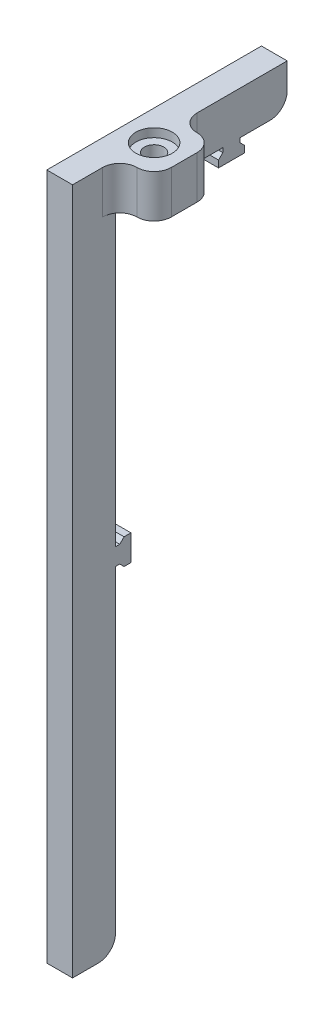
ISO-10303-21;
HEADER;
FILE_DESCRIPTION(('STEP AP214'),'2;1');
FILE_NAME('part.step','',(''),(''),'','','');
FILE_SCHEMA(('AUTOMOTIVE_DESIGN { 1 0 10303 214 1 1 1 1 }'));
ENDSEC;
DATA;
#1=APPLICATION_CONTEXT('core data for automotive mechanical design processes');
#2=APPLICATION_PROTOCOL_DEFINITION('international standard','automotive_design',2000,#1);
#3=PRODUCT_CONTEXT('',#1,'mechanical');
#4=PRODUCT('Part','Part','',(#3));
#5=PRODUCT_RELATED_PRODUCT_CATEGORY('part','',(#4));
#6=PRODUCT_DEFINITION_FORMATION('','',#4);
#7=PRODUCT_DEFINITION_CONTEXT('part definition',#1,'design');
#8=PRODUCT_DEFINITION('design','',#6,#7);
#9=PRODUCT_DEFINITION_SHAPE('','',#8);
#10=(LENGTH_UNIT() NAMED_UNIT(*) SI_UNIT(.MILLI.,.METRE.));
#11=(NAMED_UNIT(*) PLANE_ANGLE_UNIT() SI_UNIT($,.RADIAN.));
#12=(NAMED_UNIT(*) SI_UNIT($,.STERADIAN.) SOLID_ANGLE_UNIT());
#13=UNCERTAINTY_MEASURE_WITH_UNIT(LENGTH_MEASURE(1.E-05),#10,'distance_accuracy_value','');
#14=(GEOMETRIC_REPRESENTATION_CONTEXT(3) GLOBAL_UNCERTAINTY_ASSIGNED_CONTEXT((#13)) GLOBAL_UNIT_ASSIGNED_CONTEXT((#10,
#11,#12)) REPRESENTATION_CONTEXT('',''));
#15=CARTESIAN_POINT('',(0.,0.,0.));
#16=DIRECTION('',(0.,0.,1.));
#17=DIRECTION('',(1.,0.,0.));
#18=AXIS2_PLACEMENT_3D('',#15,#16,#17);
#19=CARTESIAN_POINT('',(6.,-160.,-10.));
#20=DIRECTION('',(0.,0.,1.));
#21=DIRECTION('',(1.,0.,0.));
#22=AXIS2_PLACEMENT_3D('',#19,#20,#21);
#23=PLANE('',#22);
#24=DIRECTION('',(0.,1.,0.));
#25=VECTOR('',#24,1.);
#26=CARTESIAN_POINT('',(6.,-160.,-10.));
#27=LINE('',#26,#25);
#28=CARTESIAN_POINT('',(6.,-78.,-10.));
#29=VERTEX_POINT('',#28);
#30=CARTESIAN_POINT('',(6.,-9.99999999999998,-10.));
#31=VERTEX_POINT('',#30);
#32=EDGE_CURVE('E297',#29,#31,#27,.T.);
#33=ORIENTED_EDGE('',*,*,#32,.F.);
#34=DIRECTION('',(-1.,0.,0.));
#35=VECTOR('',#34,1.);
#36=CARTESIAN_POINT('',(6.,-78.,-10.));
#37=LINE('',#36,#35);
#38=CARTESIAN_POINT('',(0.,-78.,-10.));
#39=VERTEX_POINT('',#38);
#40=EDGE_CURVE('E316',#29,#39,#37,.T.);
#41=ORIENTED_EDGE('',*,*,#40,.T.);
#42=DIRECTION('',(0.,1.,0.));
#43=VECTOR('',#42,1.);
#44=CARTESIAN_POINT('',(0.,-160.,-10.));
#45=LINE('',#44,#43);
#46=CARTESIAN_POINT('',(0.,-9.99999999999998,-10.));
#47=VERTEX_POINT('',#46);
#48=EDGE_CURVE('E414',#39,#47,#45,.T.);
#49=ORIENTED_EDGE('',*,*,#48,.T.);
#50=DIRECTION('',(-1.,0.,0.));
#51=VECTOR('',#50,1.);
#52=CARTESIAN_POINT('',(6.,-9.99999999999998,-10.));
#53=LINE('',#52,#51);
#54=EDGE_CURVE('E428',#31,#47,#53,.T.);
#55=ORIENTED_EDGE('',*,*,#54,.F.);
#56=EDGE_LOOP('',(#33,#41,#49,#55));
#57=FACE_BOUND('',#56,.T.);
#58=ADVANCED_FACE('F41',(#57),#23,.F.);
#59=CARTESIAN_POINT('',(6.,-9.99999999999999,-50.));
#60=DIRECTION('',(0.,1.,0.));
#61=DIRECTION('',(0.,0.,1.));
#62=AXIS2_PLACEMENT_3D('',#59,#60,#61);
#63=PLANE('',#62);
#64=CARTESIAN_POINT('',(7.,-9.99999999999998,-18.));
#65=DIRECTION('',(0.,1.,0.));
#66=DIRECTION('',(0.,0.,1.));
#67=AXIS2_PLACEMENT_3D('',#64,#65,#66);
#68=CIRCLE('',#67,5.25);
#69=CARTESIAN_POINT('',(7.,-9.99999999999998,-12.75));
#70=VERTEX_POINT('',#69);
#71=EDGE_CURVE('E437',#70,#70,#68,.T.);
#72=ORIENTED_EDGE('',*,*,#71,.T.);
#73=EDGE_LOOP('',(#72));
#74=FACE_BOUND('',#73,.T.);
#75=DIRECTION('',(0.,0.,-1.));
#76=VECTOR('',#75,1.);
#77=CARTESIAN_POINT('',(0.,-9.99999999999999,-50.));
#78=LINE('',#77,#76);
#79=CARTESIAN_POINT('',(0.,-9.99999999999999,-35.));
#80=VERTEX_POINT('',#79);
#81=EDGE_CURVE('E418',#47,#80,#78,.T.);
#82=ORIENTED_EDGE('',*,*,#81,.T.);
#83=DIRECTION('',(-1.,0.,0.));
#84=VECTOR('',#83,1.);
#85=CARTESIAN_POINT('',(6.,-9.99999999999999,-35.));
#86=LINE('',#85,#84);
#87=CARTESIAN_POINT('',(6.,-9.99999999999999,-35.));
#88=VERTEX_POINT('',#87);
#89=EDGE_CURVE('E64',#88,#80,#86,.T.);
#90=ORIENTED_EDGE('',*,*,#89,.F.);
#91=DIRECTION('',(0.,0.,-1.));
#92=VECTOR('',#91,1.);
#93=CARTESIAN_POINT('',(6.,-9.99999999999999,-50.));
#94=LINE('',#93,#92);
#95=CARTESIAN_POINT('',(6.,-9.99999999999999,-29.));
#96=VERTEX_POINT('',#95);
#97=EDGE_CURVE('E400',#96,#88,#94,.T.);
#98=ORIENTED_EDGE('',*,*,#97,.F.);
#99=CARTESIAN_POINT('',(10.,-9.99999999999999,-29.));
#100=DIRECTION('',(0.,1.,0.));
#101=DIRECTION('',(0.,0.,1.));
#102=AXIS2_PLACEMENT_3D('',#99,#100,#101);
#103=CIRCLE('',#102,4.);
#104=CARTESIAN_POINT('',(10.,-9.99999999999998,-25.));
#105=VERTEX_POINT('',#104);
#106=EDGE_CURVE('E466',#96,#105,#103,.T.);
#107=ORIENTED_EDGE('',*,*,#106,.T.);
#108=CARTESIAN_POINT('',(10.,-9.99999999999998,-21.));
#109=DIRECTION('',(0.,1.,0.));
#110=DIRECTION('',(0.,0.,1.));
#111=AXIS2_PLACEMENT_3D('',#108,#109,#110);
#112=CIRCLE('',#111,4.);
#113=CARTESIAN_POINT('',(14.,-9.99999999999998,-21.));
#114=VERTEX_POINT('',#113);
#115=EDGE_CURVE('E454',#105,#114,#112,.F.);
#116=ORIENTED_EDGE('',*,*,#115,.T.);
#117=DIRECTION('',(0.,0.,-1.));
#118=VECTOR('',#117,1.);
#119=CARTESIAN_POINT('',(14.,-9.99999999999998,-25.));
#120=LINE('',#119,#118);
#121=CARTESIAN_POINT('',(14.,-9.99999999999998,-15.));
#122=VERTEX_POINT('',#121);
#123=EDGE_CURVE('E385',#122,#114,#120,.T.);
#124=ORIENTED_EDGE('',*,*,#123,.F.);
#125=CARTESIAN_POINT('',(10.,-9.99999999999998,-15.));
#126=DIRECTION('',(0.,1.,0.));
#127=DIRECTION('',(0.,0.,1.));
#128=AXIS2_PLACEMENT_3D('',#125,#126,#127);
#129=CIRCLE('',#128,4.);
#130=CARTESIAN_POINT('',(10.,-9.99999999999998,-11.));
#131=VERTEX_POINT('',#130);
#132=EDGE_CURVE('E456',#122,#131,#129,.F.);
#133=ORIENTED_EDGE('',*,*,#132,.T.);
#134=CARTESIAN_POINT('',(10.,-9.99999999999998,-7.));
#135=DIRECTION('',(0.,1.,0.));
#136=DIRECTION('',(0.,0.,1.));
#137=AXIS2_PLACEMENT_3D('',#134,#135,#136);
#138=CIRCLE('',#137,4.);
#139=CARTESIAN_POINT('',(6.,-9.99999999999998,-7.));
#140=VERTEX_POINT('',#139);
#141=EDGE_CURVE('E460',#131,#140,#138,.T.);
#142=ORIENTED_EDGE('',*,*,#141,.T.);
#143=DIRECTION('',(0.,0.,-1.));
#144=VECTOR('',#143,1.);
#145=CARTESIAN_POINT('',(6.,-9.99999999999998,0.));
#146=LINE('',#145,#144);
#147=EDGE_CURVE('E370',#140,#31,#146,.T.);
#148=ORIENTED_EDGE('',*,*,#147,.T.);
#149=ORIENTED_EDGE('',*,*,#54,.T.);
#150=EDGE_LOOP('',(#82,#90,#98,#107,#116,#124,#133,#142,#148,#149));
#151=FACE_BOUND('',#150,.T.);
#152=ADVANCED_FACE('F537',(#74,#151),#63,.F.);
#153=CARTESIAN_POINT('',(7.,-16.,-18.));
#154=DIRECTION('',(0.,1.,0.));
#155=DIRECTION('',(0.,0.,1.));
#156=AXIS2_PLACEMENT_3D('',#153,#154,#155);
#157=CYLINDRICAL_SURFACE('',#156,4.25);
#158=CARTESIAN_POINT('',(7.,-8.99999999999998,-18.));
#159=DIRECTION('',(0.,1.,0.));
#160=DIRECTION('',(0.,0.,1.));
#161=AXIS2_PLACEMENT_3D('',#158,#159,#160);
#162=CIRCLE('',#161,4.25);
#163=CARTESIAN_POINT('',(7.,-8.99999999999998,-13.75));
#164=VERTEX_POINT('',#163);
#165=EDGE_CURVE('E440',#164,#164,#162,.F.);
#166=ORIENTED_EDGE('',*,*,#165,.T.);
#167=EDGE_LOOP('',(#166));
#168=FACE_BOUND('',#167,.T.);
#169=CARTESIAN_POINT('',(7.,-7.99999999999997,-18.));
#170=DIRECTION('',(0.,1.,0.));
#171=DIRECTION('',(0.,0.,1.));
#172=AXIS2_PLACEMENT_3D('',#169,#170,#171);
#173=CIRCLE('',#172,4.25);
#174=CARTESIAN_POINT('',(7.,-7.99999999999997,-13.75));
#175=VERTEX_POINT('',#174);
#176=EDGE_CURVE('E434',#175,#175,#173,.T.);
#177=ORIENTED_EDGE('',*,*,#176,.T.);
#178=EDGE_LOOP('',(#177));
#179=FACE_BOUND('',#178,.T.);
#180=ADVANCED_FACE('F614',(#168,#179),#157,.F.);
#181=CARTESIAN_POINT('',(6.,0.,0.));
#182=DIRECTION('',(1.,0.,0.));
#183=DIRECTION('',(0.,0.,-1.));
#184=AXIS2_PLACEMENT_3D('',#181,#182,#183);
#185=PLANE('',#184);
#186=ORIENTED_EDGE('',*,*,#97,.T.);
#187=DIRECTION('',(0.,1.,0.));
#188=VECTOR('',#187,1.);
#189=CARTESIAN_POINT('',(6.,-11.,-35.));
#190=LINE('',#189,#188);
#191=CARTESIAN_POINT('',(6.,-11.,-35.));
#192=VERTEX_POINT('',#191);
#193=EDGE_CURVE('E278',#192,#88,#190,.T.);
#194=ORIENTED_EDGE('',*,*,#193,.F.);
#195=DIRECTION('',(0.,0.707106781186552,-0.707106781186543));
#196=VECTOR('',#195,1.);
#197=CARTESIAN_POINT('',(6.,-12.,-34.));
#198=LINE('',#197,#196);
#199=CARTESIAN_POINT('',(6.,-12.,-34.));
#200=VERTEX_POINT('',#199);
#201=EDGE_CURVE('E275',#200,#192,#198,.T.);
#202=ORIENTED_EDGE('',*,*,#201,.F.);
#203=DIRECTION('',(0.,1.,0.));
#204=VECTOR('',#203,1.);
#205=CARTESIAN_POINT('',(6.,-13.6,-34.));
#206=LINE('',#205,#204);
#207=CARTESIAN_POINT('',(6.,-13.6,-34.));
#208=VERTEX_POINT('',#207);
#209=EDGE_CURVE('E272',#208,#200,#206,.T.);
#210=ORIENTED_EDGE('',*,*,#209,.F.);
#211=DIRECTION('',(0.,0.,1.));
#212=VECTOR('',#211,1.);
#213=CARTESIAN_POINT('',(6.,-13.6,-40.));
#214=LINE('',#213,#212);
#215=CARTESIAN_POINT('',(6.,-13.6,-40.));
#216=VERTEX_POINT('',#215);
#217=EDGE_CURVE('E269',#216,#208,#214,.T.);
#218=ORIENTED_EDGE('',*,*,#217,.F.);
#219=DIRECTION('',(0.,-1.,0.));
#220=VECTOR('',#219,1.);
#221=CARTESIAN_POINT('',(6.,-12.,-40.));
#222=LINE('',#221,#220);
#223=CARTESIAN_POINT('',(6.,-12.,-40.));
#224=VERTEX_POINT('',#223);
#225=EDGE_CURVE('E259',#224,#216,#222,.T.);
#226=ORIENTED_EDGE('',*,*,#225,.F.);
#227=DIRECTION('',(0.,-0.707106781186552,-0.707106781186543));
#228=VECTOR('',#227,1.);
#229=CARTESIAN_POINT('',(6.,-11.,-39.));
#230=LINE('',#229,#228);
#231=CARTESIAN_POINT('',(6.,-11.,-39.));
#232=VERTEX_POINT('',#231);
#233=EDGE_CURVE('E242',#232,#224,#230,.T.);
#234=ORIENTED_EDGE('',*,*,#233,.F.);
#235=DIRECTION('',(0.,-1.,0.));
#236=VECTOR('',#235,1.);
#237=CARTESIAN_POINT('',(6.,-9.99999999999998,-39.));
#238=LINE('',#237,#236);
#239=CARTESIAN_POINT('',(6.,-9.99999999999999,-39.));
#240=VERTEX_POINT('',#239);
#241=EDGE_CURVE('E256',#240,#232,#238,.T.);
#242=ORIENTED_EDGE('',*,*,#241,.F.);
#243=CARTESIAN_POINT('',(6.,-9.99999999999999,-46.));
#244=VERTEX_POINT('',#243);
#245=EDGE_CURVE('E56',#240,#244,#94,.T.);
#246=ORIENTED_EDGE('',*,*,#245,.T.);
#247=CARTESIAN_POINT('',(6.,-5.99999999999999,-46.));
#248=DIRECTION('',(1.,0.,0.));
#249=DIRECTION('',(0.,0.,-1.));
#250=AXIS2_PLACEMENT_3D('',#247,#248,#249);
#251=CIRCLE('',#250,4.);
#252=CARTESIAN_POINT('',(6.,-5.99999999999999,-50.));
#253=VERTEX_POINT('',#252);
#254=EDGE_CURVE('E482',#244,#253,#251,.T.);
#255=ORIENTED_EDGE('',*,*,#254,.T.);
#256=DIRECTION('',(0.,1.,0.));
#257=VECTOR('',#256,1.);
#258=CARTESIAN_POINT('',(6.,-9.99999999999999,-50.));
#259=LINE('',#258,#257);
#260=CARTESIAN_POINT('',(6.,0.,-50.));
#261=VERTEX_POINT('',#260);
#262=EDGE_CURVE('E402',#253,#261,#259,.T.);
#263=ORIENTED_EDGE('',*,*,#262,.T.);
#264=DIRECTION('',(0.,0.,1.));
#265=VECTOR('',#264,1.);
#266=CARTESIAN_POINT('',(6.,0.,0.));
#267=LINE('',#266,#265);
#268=CARTESIAN_POINT('',(6.,0.,-29.));
#269=VERTEX_POINT('',#268);
#270=EDGE_CURVE('E405',#261,#269,#267,.T.);
#271=ORIENTED_EDGE('',*,*,#270,.T.);
#272=DIRECTION('',(0.,1.,0.));
#273=VECTOR('',#272,1.);
#274=CARTESIAN_POINT('',(6.,-9.99999999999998,-29.));
#275=LINE('',#274,#273);
#276=EDGE_CURVE('E458',#269,#96,#275,.F.);
#277=ORIENTED_EDGE('',*,*,#276,.T.);
#278=EDGE_LOOP('',(#186,#194,#202,#210,#218,#226,#234,#242,#246,#255,#263,#271,#277));
#279=FACE_BOUND('',#278,.T.);
#280=ADVANCED_FACE('F255',(#279),#185,.T.);
#281=CARTESIAN_POINT('',(6.,0.,0.));
#282=DIRECTION('',(0.,0.,-1.));
#283=DIRECTION('',(-1.,0.,0.));
#284=AXIS2_PLACEMENT_3D('',#281,#282,#283);
#285=PLANE('',#284);
#286=DIRECTION('',(0.,-1.,0.));
#287=VECTOR('',#286,1.);
#288=CARTESIAN_POINT('',(0.,0.,0.));
#289=LINE('',#288,#287);
#290=CARTESIAN_POINT('',(0.,0.,0.));
#291=VERTEX_POINT('',#290);
#292=CARTESIAN_POINT('',(0.,-160.,0.));
#293=VERTEX_POINT('',#292);
#294=EDGE_CURVE('E393',#291,#293,#289,.T.);
#295=ORIENTED_EDGE('',*,*,#294,.T.);
#296=DIRECTION('',(-1.,0.,0.));
#297=VECTOR('',#296,1.);
#298=CARTESIAN_POINT('',(6.,-160.,0.));
#299=LINE('',#298,#297);
#300=CARTESIAN_POINT('',(6.,-160.,0.));
#301=VERTEX_POINT('',#300);
#302=EDGE_CURVE('E431',#301,#293,#299,.T.);
#303=ORIENTED_EDGE('',*,*,#302,.F.);
#304=DIRECTION('',(0.,-1.,0.));
#305=VECTOR('',#304,1.);
#306=CARTESIAN_POINT('',(6.,0.,0.));
#307=LINE('',#306,#305);
#308=CARTESIAN_POINT('',(6.,0.,0.));
#309=VERTEX_POINT('',#308);
#310=EDGE_CURVE('E394',#309,#301,#307,.T.);
#311=ORIENTED_EDGE('',*,*,#310,.F.);
#312=DIRECTION('',(-1.,0.,0.));
#313=VECTOR('',#312,1.);
#314=CARTESIAN_POINT('',(6.,0.,0.));
#315=LINE('',#314,#313);
#316=EDGE_CURVE('E408',#309,#291,#315,.T.);
#317=ORIENTED_EDGE('',*,*,#316,.T.);
#318=EDGE_LOOP('',(#295,#303,#311,#317));
#319=FACE_BOUND('',#318,.T.);
#320=ADVANCED_FACE('F576',(#319),#285,.F.);
#321=CARTESIAN_POINT('',(6.,-160.,0.));
#322=DIRECTION('',(0.,1.,0.));
#323=DIRECTION('',(0.,0.,1.));
#324=AXIS2_PLACEMENT_3D('',#321,#322,#323);
#325=PLANE('',#324);
#326=DIRECTION('',(0.,0.,-1.));
#327=VECTOR('',#326,1.);
#328=CARTESIAN_POINT('',(0.,-160.,0.));
#329=LINE('',#328,#327);
#330=CARTESIAN_POINT('',(0.,-160.,-6.00000000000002));
#331=VERTEX_POINT('',#330);
#332=EDGE_CURVE('E411',#293,#331,#329,.T.);
#333=ORIENTED_EDGE('',*,*,#332,.T.);
#334=DIRECTION('',(-1.,0.,0.));
#335=VECTOR('',#334,1.);
#336=CARTESIAN_POINT('',(6.,-160.,-6.00000000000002));
#337=LINE('',#336,#335);
#338=CARTESIAN_POINT('',(6.,-160.,-6.00000000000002));
#339=VERTEX_POINT('',#338);
#340=EDGE_CURVE('E49',#331,#339,#337,.F.);
#341=ORIENTED_EDGE('',*,*,#340,.T.);
#342=DIRECTION('',(0.,0.,-1.));
#343=VECTOR('',#342,1.);
#344=CARTESIAN_POINT('',(6.,-160.,0.));
#345=LINE('',#344,#343);
#346=EDGE_CURVE('E396',#301,#339,#345,.T.);
#347=ORIENTED_EDGE('',*,*,#346,.F.);
#348=ORIENTED_EDGE('',*,*,#302,.T.);
#349=EDGE_LOOP('',(#333,#341,#347,#348));
#350=FACE_BOUND('',#349,.T.);
#351=ADVANCED_FACE('F489',(#350),#325,.F.);
#352=CARTESIAN_POINT('',(0.,-156.,-10.));
#353=VERTEX_POINT('',#352);
#354=CARTESIAN_POINT('',(0.,-82.,-10.));
#355=VERTEX_POINT('',#354);
#356=EDGE_CURVE('E415',#353,#355,#45,.T.);
#357=ORIENTED_EDGE('',*,*,#356,.T.);
#358=DIRECTION('',(-1.,0.,0.));
#359=VECTOR('',#358,1.);
#360=CARTESIAN_POINT('',(6.,-82.,-10.));
#361=LINE('',#360,#359);
#362=CARTESIAN_POINT('',(6.,-82.,-10.));
#363=VERTEX_POINT('',#362);
#364=EDGE_CURVE('E313',#363,#355,#361,.T.);
#365=ORIENTED_EDGE('',*,*,#364,.F.);
#366=CARTESIAN_POINT('',(6.,-156.,-10.));
#367=VERTEX_POINT('',#366);
#368=EDGE_CURVE('E367',#367,#363,#27,.T.);
#369=ORIENTED_EDGE('',*,*,#368,.F.);
#370=DIRECTION('',(-1.,0.,0.));
#371=VECTOR('',#370,1.);
#372=CARTESIAN_POINT('',(6.,-156.,-10.));
#373=LINE('',#372,#371);
#374=EDGE_CURVE('E484',#367,#353,#373,.T.);
#375=ORIENTED_EDGE('',*,*,#374,.T.);
#376=EDGE_LOOP('',(#357,#365,#369,#375));
#377=FACE_BOUND('',#376,.T.);
#378=ADVANCED_FACE('F500',(#377),#23,.F.);
#379=ORIENTED_EDGE('',*,*,#245,.F.);
#380=DIRECTION('',(-1.,0.,0.));
#381=VECTOR('',#380,1.);
#382=CARTESIAN_POINT('',(6.,-9.99999999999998,-39.));
#383=LINE('',#382,#381);
#384=CARTESIAN_POINT('',(0.,-9.99999999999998,-39.));
#385=VERTEX_POINT('',#384);
#386=EDGE_CURVE('E250',#240,#385,#383,.T.);
#387=ORIENTED_EDGE('',*,*,#386,.T.);
#388=CARTESIAN_POINT('',(0.,-9.99999999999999,-46.));
#389=VERTEX_POINT('',#388);
#390=EDGE_CURVE('E417',#385,#389,#78,.T.);
#391=ORIENTED_EDGE('',*,*,#390,.T.);
#392=DIRECTION('',(-1.,0.,0.));
#393=VECTOR('',#392,1.);
#394=CARTESIAN_POINT('',(6.,-9.99999999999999,-46.));
#395=LINE('',#394,#393);
#396=EDGE_CURVE('E480',#389,#244,#395,.F.);
#397=ORIENTED_EDGE('',*,*,#396,.T.);
#398=EDGE_LOOP('',(#379,#387,#391,#397));
#399=FACE_BOUND('',#398,.T.);
#400=ADVANCED_FACE('F587',(#399),#63,.F.);
#401=CARTESIAN_POINT('',(6.,-9.99999999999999,-50.));
#402=DIRECTION('',(0.,0.,1.));
#403=DIRECTION('',(1.,0.,0.));
#404=AXIS2_PLACEMENT_3D('',#401,#402,#403);
#405=PLANE('',#404);
#406=ORIENTED_EDGE('',*,*,#262,.F.);
#407=DIRECTION('',(-1.,0.,0.));
#408=VECTOR('',#407,1.);
#409=CARTESIAN_POINT('',(6.,-5.99999999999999,-50.));
#410=LINE('',#409,#408);
#411=CARTESIAN_POINT('',(0.,-5.99999999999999,-50.));
#412=VERTEX_POINT('',#411);
#413=EDGE_CURVE('E468',#253,#412,#410,.T.);
#414=ORIENTED_EDGE('',*,*,#413,.T.);
#415=DIRECTION('',(0.,1.,0.));
#416=VECTOR('',#415,1.);
#417=CARTESIAN_POINT('',(0.,-9.99999999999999,-50.));
#418=LINE('',#417,#416);
#419=CARTESIAN_POINT('',(0.,0.,-50.));
#420=VERTEX_POINT('',#419);
#421=EDGE_CURVE('E420',#412,#420,#418,.T.);
#422=ORIENTED_EDGE('',*,*,#421,.T.);
#423=DIRECTION('',(-1.,0.,0.));
#424=VECTOR('',#423,1.);
#425=CARTESIAN_POINT('',(6.,0.,-50.));
#426=LINE('',#425,#424);
#427=EDGE_CURVE('E425',#261,#420,#426,.T.);
#428=ORIENTED_EDGE('',*,*,#427,.F.);
#429=EDGE_LOOP('',(#406,#414,#422,#428));
#430=FACE_BOUND('',#429,.T.);
#431=ADVANCED_FACE('F581',(#430),#405,.F.);
#432=CARTESIAN_POINT('',(6.,0.,0.));
#433=DIRECTION('',(0.,-1.,0.));
#434=DIRECTION('',(0.,0.,-1.));
#435=AXIS2_PLACEMENT_3D('',#432,#433,#434);
#436=PLANE('',#435);
#437=CARTESIAN_POINT('',(7.,0.,-18.));
#438=DIRECTION('',(0.,1.,0.));
#439=DIRECTION('',(0.,0.,1.));
#440=AXIS2_PLACEMENT_3D('',#437,#438,#439);
#441=CIRCLE('',#440,4.25);
#442=CARTESIAN_POINT('',(7.,0.,-13.75));
#443=VERTEX_POINT('',#442);
#444=EDGE_CURVE('E388',#443,#443,#441,.T.);
#445=ORIENTED_EDGE('',*,*,#444,.F.);
#446=EDGE_LOOP('',(#445));
#447=FACE_BOUND('',#446,.T.);
#448=CARTESIAN_POINT('',(6.,0.,-7.));
#449=VERTEX_POINT('',#448);
#450=EDGE_CURVE('E404',#449,#309,#267,.T.);
#451=ORIENTED_EDGE('',*,*,#450,.F.);
#452=CARTESIAN_POINT('',(10.,0.,-7.));
#453=DIRECTION('',(0.,-1.,0.));
#454=DIRECTION('',(0.,0.,-1.));
#455=AXIS2_PLACEMENT_3D('',#452,#453,#454);
#456=CIRCLE('',#455,4.);
#457=CARTESIAN_POINT('',(10.,0.,-11.));
#458=VERTEX_POINT('',#457);
#459=EDGE_CURVE('E462',#449,#458,#456,.T.);
#460=ORIENTED_EDGE('',*,*,#459,.T.);
#461=CARTESIAN_POINT('',(10.,0.,-15.));
#462=DIRECTION('',(0.,-1.,0.));
#463=DIRECTION('',(0.,0.,-1.));
#464=AXIS2_PLACEMENT_3D('',#461,#462,#463);
#465=CIRCLE('',#464,4.);
#466=CARTESIAN_POINT('',(14.,0.,-15.));
#467=VERTEX_POINT('',#466);
#468=EDGE_CURVE('E447',#458,#467,#465,.F.);
#469=ORIENTED_EDGE('',*,*,#468,.T.);
#470=DIRECTION('',(0.,0.,-1.));
#471=VECTOR('',#470,1.);
#472=CARTESIAN_POINT('',(14.,0.,-25.));
#473=LINE('',#472,#471);
#474=CARTESIAN_POINT('',(14.,0.,-21.));
#475=VERTEX_POINT('',#474);
#476=EDGE_CURVE('E384',#467,#475,#473,.T.);
#477=ORIENTED_EDGE('',*,*,#476,.T.);
#478=CARTESIAN_POINT('',(10.,0.,-21.));
#479=DIRECTION('',(0.,-1.,0.));
#480=DIRECTION('',(0.,0.,-1.));
#481=AXIS2_PLACEMENT_3D('',#478,#479,#480);
#482=CIRCLE('',#481,4.);
#483=CARTESIAN_POINT('',(10.,0.,-25.));
#484=VERTEX_POINT('',#483);
#485=EDGE_CURVE('E445',#475,#484,#482,.F.);
#486=ORIENTED_EDGE('',*,*,#485,.T.);
#487=CARTESIAN_POINT('',(10.,0.,-29.));
#488=DIRECTION('',(0.,-1.,0.));
#489=DIRECTION('',(0.,0.,-1.));
#490=AXIS2_PLACEMENT_3D('',#487,#488,#489);
#491=CIRCLE('',#490,4.);
#492=EDGE_CURVE('E464',#484,#269,#491,.T.);
#493=ORIENTED_EDGE('',*,*,#492,.T.);
#494=ORIENTED_EDGE('',*,*,#270,.F.);
#495=ORIENTED_EDGE('',*,*,#427,.T.);
#496=DIRECTION('',(0.,0.,1.));
#497=VECTOR('',#496,1.);
#498=CARTESIAN_POINT('',(0.,0.,0.));
#499=LINE('',#498,#497);
#500=EDGE_CURVE('E397',#420,#291,#499,.T.);
#501=ORIENTED_EDGE('',*,*,#500,.T.);
#502=ORIENTED_EDGE('',*,*,#316,.F.);
#503=EDGE_LOOP('',(#451,#460,#469,#477,#486,#493,#494,#495,#501,#502));
#504=FACE_BOUND('',#503,.T.);
#505=ADVANCED_FACE('F572',(#447,#504),#436,.F.);
#506=ORIENTED_EDGE('',*,*,#346,.T.);
#507=CARTESIAN_POINT('',(6.,-156.,-6.00000000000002));
#508=DIRECTION('',(1.,0.,0.));
#509=DIRECTION('',(0.,0.,-1.));
#510=AXIS2_PLACEMENT_3D('',#507,#508,#509);
#511=CIRCLE('',#510,4.);
#512=EDGE_CURVE('E11',#339,#367,#511,.T.);
#513=ORIENTED_EDGE('',*,*,#512,.T.);
#514=ORIENTED_EDGE('',*,*,#368,.T.);
#515=DIRECTION('',(0.,0.,1.));
#516=VECTOR('',#515,1.);
#517=CARTESIAN_POINT('',(6.,-82.,-10.));
#518=LINE('',#517,#516);
#519=CARTESIAN_POINT('',(6.,-82.,-11.));
#520=VERTEX_POINT('',#519);
#521=EDGE_CURVE('E359',#520,#363,#518,.T.);
#522=ORIENTED_EDGE('',*,*,#521,.F.);
#523=DIRECTION('',(0.,0.707106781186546,0.707106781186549));
#524=VECTOR('',#523,1.);
#525=CARTESIAN_POINT('',(6.,-82.,-11.));
#526=LINE('',#525,#524);
#527=CARTESIAN_POINT('',(6.,-83.,-12.));
#528=VERTEX_POINT('',#527);
#529=EDGE_CURVE('E362',#528,#520,#526,.T.);
#530=ORIENTED_EDGE('',*,*,#529,.F.);
#531=DIRECTION('',(0.,0.,1.));
#532=VECTOR('',#531,1.);
#533=CARTESIAN_POINT('',(6.,-83.,-12.));
#534=LINE('',#533,#532);
#535=CARTESIAN_POINT('',(6.,-83.,-13.6));
#536=VERTEX_POINT('',#535);
#537=EDGE_CURVE('E331',#536,#528,#534,.T.);
#538=ORIENTED_EDGE('',*,*,#537,.F.);
#539=DIRECTION('',(0.,-1.,0.));
#540=VECTOR('',#539,1.);
#541=CARTESIAN_POINT('',(6.,-83.,-13.6));
#542=LINE('',#541,#540);
#543=CARTESIAN_POINT('',(6.,-77.,-13.6));
#544=VERTEX_POINT('',#543);
#545=EDGE_CURVE('E310',#544,#536,#542,.T.);
#546=ORIENTED_EDGE('',*,*,#545,.F.);
#547=DIRECTION('',(0.,0.,-1.));
#548=VECTOR('',#547,1.);
#549=CARTESIAN_POINT('',(6.,-77.,-13.6));
#550=LINE('',#549,#548);
#551=CARTESIAN_POINT('',(6.,-77.,-12.));
#552=VERTEX_POINT('',#551);
#553=EDGE_CURVE('E350',#552,#544,#550,.T.);
#554=ORIENTED_EDGE('',*,*,#553,.F.);
#555=DIRECTION('',(0.,0.707106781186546,-0.707106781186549));
#556=VECTOR('',#555,1.);
#557=CARTESIAN_POINT('',(6.,-77.,-12.));
#558=LINE('',#557,#556);
#559=CARTESIAN_POINT('',(6.,-78.,-11.));
#560=VERTEX_POINT('',#559);
#561=EDGE_CURVE('E353',#560,#552,#558,.T.);
#562=ORIENTED_EDGE('',*,*,#561,.F.);
#563=DIRECTION('',(0.,0.,-1.));
#564=VECTOR('',#563,1.);
#565=CARTESIAN_POINT('',(6.,-78.,-11.));
#566=LINE('',#565,#564);
#567=EDGE_CURVE('E356',#29,#560,#566,.T.);
#568=ORIENTED_EDGE('',*,*,#567,.F.);
#569=ORIENTED_EDGE('',*,*,#32,.T.);
#570=ORIENTED_EDGE('',*,*,#147,.F.);
#571=DIRECTION('',(0.,-1.,0.));
#572=VECTOR('',#571,1.);
#573=CARTESIAN_POINT('',(6.,0.,-7.));
#574=LINE('',#573,#572);
#575=EDGE_CURVE('E443',#140,#449,#574,.F.);
#576=ORIENTED_EDGE('',*,*,#575,.T.);
#577=ORIENTED_EDGE('',*,*,#450,.T.);
#578=ORIENTED_EDGE('',*,*,#310,.T.);
#579=EDGE_LOOP('',(#506,#513,#514,#522,#530,#538,#546,#554,#562,#568,#569,#570,#576,#577,#578));
#580=FACE_BOUND('',#579,.T.);
#581=ADVANCED_FACE('F494',(#580),#185,.T.);
#582=CARTESIAN_POINT('',(0.,0.,0.));
#583=DIRECTION('',(1.,0.,0.));
#584=DIRECTION('',(0.,0.,-1.));
#585=AXIS2_PLACEMENT_3D('',#582,#583,#584);
#586=PLANE('',#585);
#587=ORIENTED_EDGE('',*,*,#421,.F.);
#588=CARTESIAN_POINT('',(0.,-5.99999999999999,-46.));
#589=DIRECTION('',(1.,0.,0.));
#590=DIRECTION('',(0.,0.,-1.));
#591=AXIS2_PLACEMENT_3D('',#588,#589,#590);
#592=CIRCLE('',#591,4.);
#593=EDGE_CURVE('E477',#412,#389,#592,.F.);
#594=ORIENTED_EDGE('',*,*,#593,.T.);
#595=ORIENTED_EDGE('',*,*,#390,.F.);
#596=DIRECTION('',(0.,-1.,0.));
#597=VECTOR('',#596,1.);
#598=CARTESIAN_POINT('',(0.,-9.99999999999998,-39.));
#599=LINE('',#598,#597);
#600=CARTESIAN_POINT('',(0.,-11.,-39.));
#601=VERTEX_POINT('',#600);
#602=EDGE_CURVE('E281',#385,#601,#599,.T.);
#603=ORIENTED_EDGE('',*,*,#602,.T.);
#604=DIRECTION('',(0.,-0.707106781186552,-0.707106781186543));
#605=VECTOR('',#604,1.);
#606=CARTESIAN_POINT('',(0.,-11.,-39.));
#607=LINE('',#606,#605);
#608=CARTESIAN_POINT('',(0.,-12.,-40.));
#609=VERTEX_POINT('',#608);
#610=EDGE_CURVE('E244',#601,#609,#607,.T.);
#611=ORIENTED_EDGE('',*,*,#610,.T.);
#612=DIRECTION('',(0.,-1.,0.));
#613=VECTOR('',#612,1.);
#614=CARTESIAN_POINT('',(0.,-12.,-40.));
#615=LINE('',#614,#613);
#616=CARTESIAN_POINT('',(0.,-13.6,-40.));
#617=VERTEX_POINT('',#616);
#618=EDGE_CURVE('E285',#609,#617,#615,.T.);
#619=ORIENTED_EDGE('',*,*,#618,.T.);
#620=DIRECTION('',(0.,0.,1.));
#621=VECTOR('',#620,1.);
#622=CARTESIAN_POINT('',(0.,-13.6,-40.));
#623=LINE('',#622,#621);
#624=CARTESIAN_POINT('',(0.,-13.6,-34.));
#625=VERTEX_POINT('',#624);
#626=EDGE_CURVE('E288',#617,#625,#623,.T.);
#627=ORIENTED_EDGE('',*,*,#626,.T.);
#628=DIRECTION('',(0.,1.,0.));
#629=VECTOR('',#628,1.);
#630=CARTESIAN_POINT('',(0.,-13.6,-34.));
#631=LINE('',#630,#629);
#632=CARTESIAN_POINT('',(0.,-12.,-34.));
#633=VERTEX_POINT('',#632);
#634=EDGE_CURVE('E291',#625,#633,#631,.T.);
#635=ORIENTED_EDGE('',*,*,#634,.T.);
#636=DIRECTION('',(0.,0.707106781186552,-0.707106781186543));
#637=VECTOR('',#636,1.);
#638=CARTESIAN_POINT('',(0.,-12.,-34.));
#639=LINE('',#638,#637);
#640=CARTESIAN_POINT('',(0.,-11.,-35.));
#641=VERTEX_POINT('',#640);
#642=EDGE_CURVE('E265',#633,#641,#639,.T.);
#643=ORIENTED_EDGE('',*,*,#642,.T.);
#644=DIRECTION('',(0.,1.,0.));
#645=VECTOR('',#644,1.);
#646=CARTESIAN_POINT('',(0.,-11.,-35.));
#647=LINE('',#646,#645);
#648=EDGE_CURVE('E262',#641,#80,#647,.T.);
#649=ORIENTED_EDGE('',*,*,#648,.T.);
#650=ORIENTED_EDGE('',*,*,#81,.F.);
#651=ORIENTED_EDGE('',*,*,#48,.F.);
#652=DIRECTION('',(0.,0.,-1.));
#653=VECTOR('',#652,1.);
#654=CARTESIAN_POINT('',(0.,-78.,-11.));
#655=LINE('',#654,#653);
#656=CARTESIAN_POINT('',(0.,-78.,-11.));
#657=VERTEX_POINT('',#656);
#658=EDGE_CURVE('E337',#39,#657,#655,.T.);
#659=ORIENTED_EDGE('',*,*,#658,.T.);
#660=DIRECTION('',(0.,0.707106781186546,-0.707106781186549));
#661=VECTOR('',#660,1.);
#662=CARTESIAN_POINT('',(0.,-77.,-12.));
#663=LINE('',#662,#661);
#664=CARTESIAN_POINT('',(0.,-77.,-12.));
#665=VERTEX_POINT('',#664);
#666=EDGE_CURVE('E334',#657,#665,#663,.T.);
#667=ORIENTED_EDGE('',*,*,#666,.T.);
#668=DIRECTION('',(0.,0.,-1.));
#669=VECTOR('',#668,1.);
#670=CARTESIAN_POINT('',(0.,-77.,-13.6));
#671=LINE('',#670,#669);
#672=CARTESIAN_POINT('',(0.,-77.,-13.6));
#673=VERTEX_POINT('',#672);
#674=EDGE_CURVE('E330',#665,#673,#671,.T.);
#675=ORIENTED_EDGE('',*,*,#674,.T.);
#676=DIRECTION('',(0.,-1.,0.));
#677=VECTOR('',#676,1.);
#678=CARTESIAN_POINT('',(0.,-83.,-13.6));
#679=LINE('',#678,#677);
#680=CARTESIAN_POINT('',(0.,-83.,-13.6));
#681=VERTEX_POINT('',#680);
#682=EDGE_CURVE('E327',#673,#681,#679,.T.);
#683=ORIENTED_EDGE('',*,*,#682,.T.);
#684=DIRECTION('',(0.,0.,1.));
#685=VECTOR('',#684,1.);
#686=CARTESIAN_POINT('',(0.,-83.,-12.));
#687=LINE('',#686,#685);
#688=CARTESIAN_POINT('',(0.,-83.,-12.));
#689=VERTEX_POINT('',#688);
#690=EDGE_CURVE('E283',#681,#689,#687,.T.);
#691=ORIENTED_EDGE('',*,*,#690,.T.);
#692=DIRECTION('',(0.,0.707106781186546,0.707106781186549));
#693=VECTOR('',#692,1.);
#694=CARTESIAN_POINT('',(0.,-82.,-11.));
#695=LINE('',#694,#693);
#696=CARTESIAN_POINT('',(0.,-82.,-11.));
#697=VERTEX_POINT('',#696);
#698=EDGE_CURVE('E343',#689,#697,#695,.T.);
#699=ORIENTED_EDGE('',*,*,#698,.T.);
#700=DIRECTION('',(0.,0.,1.));
#701=VECTOR('',#700,1.);
#702=CARTESIAN_POINT('',(0.,-82.,-10.));
#703=LINE('',#702,#701);
#704=EDGE_CURVE('E340',#697,#355,#703,.T.);
#705=ORIENTED_EDGE('',*,*,#704,.T.);
#706=ORIENTED_EDGE('',*,*,#356,.F.);
#707=CARTESIAN_POINT('',(0.,-156.,-6.00000000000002));
#708=DIRECTION('',(1.,0.,0.));
#709=DIRECTION('',(0.,0.,-1.));
#710=AXIS2_PLACEMENT_3D('',#707,#708,#709);
#711=CIRCLE('',#710,4.);
#712=EDGE_CURVE('E475',#353,#331,#711,.F.);
#713=ORIENTED_EDGE('',*,*,#712,.T.);
#714=ORIENTED_EDGE('',*,*,#332,.F.);
#715=ORIENTED_EDGE('',*,*,#294,.F.);
#716=ORIENTED_EDGE('',*,*,#500,.F.);
#717=EDGE_LOOP('',(#587,#594,#595,#603,#611,#619,#627,#635,#643,#649,#650,#651,#659,#667,#675,
#683,#691,#699,#705,#706,#713,#714,#715,#716));
#718=FACE_BOUND('',#717,.T.);
#719=ADVANCED_FACE('F503',(#718),#586,.F.);
#720=CARTESIAN_POINT('',(7.,-2.,-18.));
#721=DIRECTION('',(0.,1.,0.));
#722=DIRECTION('',(0.,0.,1.));
#723=AXIS2_PLACEMENT_3D('',#720,#721,#722);
#724=CIRCLE('',#723,4.25);
#725=CARTESIAN_POINT('',(7.,-2.,-13.75));
#726=VERTEX_POINT('',#725);
#727=EDGE_CURVE('E377',#726,#726,#724,.T.);
#728=ORIENTED_EDGE('',*,*,#727,.F.);
#729=EDGE_LOOP('',(#728));
#730=FACE_BOUND('',#729,.T.);
#731=ORIENTED_EDGE('',*,*,#444,.T.);
#732=EDGE_LOOP('',(#731));
#733=FACE_BOUND('',#732,.T.);
#734=ADVANCED_FACE('F683',(#730,#733),#157,.F.);
#735=CARTESIAN_POINT('',(14.,-9.99999999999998,-25.));
#736=DIRECTION('',(1.,0.,0.));
#737=DIRECTION('',(0.,0.,-1.));
#738=AXIS2_PLACEMENT_3D('',#735,#736,#737);
#739=PLANE('',#738);
#740=ORIENTED_EDGE('',*,*,#476,.F.);
#741=DIRECTION('',(0.,1.,0.));
#742=VECTOR('',#741,1.);
#743=CARTESIAN_POINT('',(14.,-9.99999999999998,-15.));
#744=LINE('',#743,#742);
#745=EDGE_CURVE('E452',#467,#122,#744,.F.);
#746=ORIENTED_EDGE('',*,*,#745,.T.);
#747=ORIENTED_EDGE('',*,*,#123,.T.);
#748=DIRECTION('',(0.,1.,0.));
#749=VECTOR('',#748,1.);
#750=CARTESIAN_POINT('',(14.,-9.99999999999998,-21.));
#751=LINE('',#750,#749);
#752=EDGE_CURVE('E449',#114,#475,#751,.T.);
#753=ORIENTED_EDGE('',*,*,#752,.T.);
#754=EDGE_LOOP('',(#740,#746,#747,#753));
#755=FACE_BOUND('',#754,.T.);
#756=ADVANCED_FACE('F560',(#755),#739,.T.);
#757=CARTESIAN_POINT('',(7.,-2.,-18.));
#758=DIRECTION('',(0.,1.,0.));
#759=DIRECTION('',(0.,0.,1.));
#760=AXIS2_PLACEMENT_3D('',#757,#758,#759);
#761=PLANE('',#760);
#762=CARTESIAN_POINT('',(7.,-2.,-18.));
#763=DIRECTION('',(0.,1.,0.));
#764=DIRECTION('',(0.,0.,1.));
#765=AXIS2_PLACEMENT_3D('',#762,#763,#764);
#766=CIRCLE('',#765,2.25);
#767=CARTESIAN_POINT('',(7.,-2.,-15.75));
#768=VERTEX_POINT('',#767);
#769=EDGE_CURVE('E378',#768,#768,#766,.T.);
#770=ORIENTED_EDGE('',*,*,#769,.F.);
#771=EDGE_LOOP('',(#770));
#772=FACE_BOUND('',#771,.T.);
#773=ORIENTED_EDGE('',*,*,#727,.T.);
#774=EDGE_LOOP('',(#773));
#775=FACE_BOUND('',#774,.T.);
#776=ADVANCED_FACE('F676',(#772,#775),#761,.T.);
#777=CARTESIAN_POINT('',(7.,-6.,-18.));
#778=DIRECTION('',(0.,1.,0.));
#779=DIRECTION('',(0.,0.,1.));
#780=AXIS2_PLACEMENT_3D('',#777,#778,#779);
#781=CYLINDRICAL_SURFACE('',#780,2.25);
#782=CARTESIAN_POINT('',(7.,-6.,-18.));
#783=DIRECTION('',(0.,1.,0.));
#784=DIRECTION('',(0.,0.,1.));
#785=AXIS2_PLACEMENT_3D('',#782,#783,#784);
#786=CIRCLE('',#785,2.25);
#787=CARTESIAN_POINT('',(7.,-6.,-15.75));
#788=VERTEX_POINT('',#787);
#789=EDGE_CURVE('E374',#788,#788,#786,.T.);
#790=ORIENTED_EDGE('',*,*,#789,.F.);
#791=EDGE_LOOP('',(#790));
#792=FACE_BOUND('',#791,.T.);
#793=ORIENTED_EDGE('',*,*,#769,.T.);
#794=EDGE_LOOP('',(#793));
#795=FACE_BOUND('',#794,.T.);
#796=ADVANCED_FACE('F638',(#792,#795),#781,.F.);
#797=CARTESIAN_POINT('',(7.,-6.,-18.));
#798=DIRECTION('',(0.,-1.,0.));
#799=DIRECTION('',(0.,0.,-1.));
#800=AXIS2_PLACEMENT_3D('',#797,#798,#799);
#801=CONICAL_SURFACE('',#800,2.25000000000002,0.785398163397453);
#802=ORIENTED_EDGE('',*,*,#176,.F.);
#803=EDGE_LOOP('',(#802));
#804=FACE_BOUND('',#803,.T.);
#805=ORIENTED_EDGE('',*,*,#789,.T.);
#806=EDGE_LOOP('',(#805));
#807=FACE_BOUND('',#806,.T.);
#808=ADVANCED_FACE('F632',(#804,#807),#801,.F.);
#809=CARTESIAN_POINT('',(7.,-8.99999999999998,-18.));
#810=DIRECTION('',(0.,1.,0.));
#811=DIRECTION('',(0.,0.,1.));
#812=AXIS2_PLACEMENT_3D('',#809,#810,#811);
#813=TOROIDAL_SURFACE('',#812,5.25,1.);
#814=ORIENTED_EDGE('',*,*,#165,.F.);
#815=EDGE_LOOP('',(#814));
#816=FACE_BOUND('',#815,.T.);
#817=ORIENTED_EDGE('',*,*,#71,.F.);
#818=EDGE_LOOP('',(#817));
#819=FACE_BOUND('',#818,.T.);
#820=ADVANCED_FACE('F637',(#816,#819),#813,.T.);
#821=CARTESIAN_POINT('',(10.,-9.99999999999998,-15.));
#822=DIRECTION('',(0.,1.,0.));
#823=DIRECTION('',(0.,0.,1.));
#824=AXIS2_PLACEMENT_3D('',#821,#822,#823);
#825=CYLINDRICAL_SURFACE('',#824,4.);
#826=ORIENTED_EDGE('',*,*,#745,.F.);
#827=ORIENTED_EDGE('',*,*,#468,.F.);
#828=DIRECTION('',(0.,1.,0.));
#829=VECTOR('',#828,1.);
#830=CARTESIAN_POINT('',(10.,-9.99999999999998,-11.));
#831=LINE('',#830,#829);
#832=EDGE_CURVE('E381',#131,#458,#831,.T.);
#833=ORIENTED_EDGE('',*,*,#832,.F.);
#834=ORIENTED_EDGE('',*,*,#132,.F.);
#835=EDGE_LOOP('',(#826,#827,#833,#834));
#836=FACE_BOUND('',#835,.T.);
#837=ADVANCED_FACE('F564',(#836),#825,.T.);
#838=CARTESIAN_POINT('',(10.,-9.99999999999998,-7.));
#839=DIRECTION('',(0.,1.,0.));
#840=DIRECTION('',(0.,0.,1.));
#841=AXIS2_PLACEMENT_3D('',#838,#839,#840);
#842=CYLINDRICAL_SURFACE('',#841,4.);
#843=ORIENTED_EDGE('',*,*,#575,.F.);
#844=ORIENTED_EDGE('',*,*,#141,.F.);
#845=ORIENTED_EDGE('',*,*,#832,.T.);
#846=ORIENTED_EDGE('',*,*,#459,.F.);
#847=EDGE_LOOP('',(#843,#844,#845,#846));
#848=FACE_BOUND('',#847,.T.);
#849=ADVANCED_FACE('F568',(#848),#842,.F.);
#850=CARTESIAN_POINT('',(10.,-9.99999999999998,-29.));
#851=DIRECTION('',(0.,-1.,0.));
#852=DIRECTION('',(0.,0.,-1.));
#853=AXIS2_PLACEMENT_3D('',#850,#851,#852);
#854=CYLINDRICAL_SURFACE('',#853,4.);
#855=DIRECTION('',(0.,1.,0.));
#856=VECTOR('',#855,1.);
#857=CARTESIAN_POINT('',(10.,0.,-25.));
#858=LINE('',#857,#856);
#859=EDGE_CURVE('E373',#105,#484,#858,.T.);
#860=ORIENTED_EDGE('',*,*,#859,.F.);
#861=ORIENTED_EDGE('',*,*,#106,.F.);
#862=ORIENTED_EDGE('',*,*,#276,.F.);
#863=ORIENTED_EDGE('',*,*,#492,.F.);
#864=EDGE_LOOP('',(#860,#861,#862,#863));
#865=FACE_BOUND('',#864,.T.);
#866=ADVANCED_FACE('F550',(#865),#854,.F.);
#867=CARTESIAN_POINT('',(10.,-9.99999999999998,-21.));
#868=DIRECTION('',(0.,1.,0.));
#869=DIRECTION('',(0.,0.,1.));
#870=AXIS2_PLACEMENT_3D('',#867,#868,#869);
#871=CYLINDRICAL_SURFACE('',#870,4.);
#872=ORIENTED_EDGE('',*,*,#115,.F.);
#873=ORIENTED_EDGE('',*,*,#859,.T.);
#874=ORIENTED_EDGE('',*,*,#485,.F.);
#875=ORIENTED_EDGE('',*,*,#752,.F.);
#876=EDGE_LOOP('',(#872,#873,#874,#875));
#877=FACE_BOUND('',#876,.T.);
#878=ADVANCED_FACE('F555',(#877),#871,.T.);
#879=CARTESIAN_POINT('',(6.,-5.99999999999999,-46.));
#880=DIRECTION('',(-1.,0.,0.));
#881=DIRECTION('',(0.,0.,1.));
#882=AXIS2_PLACEMENT_3D('',#879,#880,#881);
#883=CYLINDRICAL_SURFACE('',#882,4.);
#884=ORIENTED_EDGE('',*,*,#254,.F.);
#885=ORIENTED_EDGE('',*,*,#396,.F.);
#886=ORIENTED_EDGE('',*,*,#593,.F.);
#887=ORIENTED_EDGE('',*,*,#413,.F.);
#888=EDGE_LOOP('',(#884,#885,#886,#887));
#889=FACE_BOUND('',#888,.T.);
#890=ADVANCED_FACE('F586',(#889),#883,.T.);
#891=CARTESIAN_POINT('',(6.,-156.,-6.00000000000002));
#892=DIRECTION('',(-1.,0.,0.));
#893=DIRECTION('',(0.,0.,1.));
#894=AXIS2_PLACEMENT_3D('',#891,#892,#893);
#895=CYLINDRICAL_SURFACE('',#894,4.);
#896=ORIENTED_EDGE('',*,*,#512,.F.);
#897=ORIENTED_EDGE('',*,*,#340,.F.);
#898=ORIENTED_EDGE('',*,*,#712,.F.);
#899=ORIENTED_EDGE('',*,*,#374,.F.);
#900=EDGE_LOOP('',(#896,#897,#898,#899));
#901=FACE_BOUND('',#900,.T.);
#902=ADVANCED_FACE('F43',(#901),#895,.T.);
#903=CARTESIAN_POINT('',(6.,-83.,-12.));
#904=DIRECTION('',(0.,-1.,0.));
#905=DIRECTION('',(0.,0.,-1.));
#906=AXIS2_PLACEMENT_3D('',#903,#904,#905);
#907=PLANE('',#906);
#908=ORIENTED_EDGE('',*,*,#690,.F.);
#909=DIRECTION('',(-1.,0.,0.));
#910=VECTOR('',#909,1.);
#911=CARTESIAN_POINT('',(6.,-83.,-13.6));
#912=LINE('',#911,#910);
#913=EDGE_CURVE('E325',#536,#681,#912,.T.);
#914=ORIENTED_EDGE('',*,*,#913,.F.);
#915=ORIENTED_EDGE('',*,*,#537,.T.);
#916=DIRECTION('',(-1.,0.,0.));
#917=VECTOR('',#916,1.);
#918=CARTESIAN_POINT('',(6.,-83.,-12.));
#919=LINE('',#918,#917);
#920=EDGE_CURVE('E308',#528,#689,#919,.T.);
#921=ORIENTED_EDGE('',*,*,#920,.T.);
#922=EDGE_LOOP('',(#908,#914,#915,#921));
#923=FACE_BOUND('',#922,.T.);
#924=ADVANCED_FACE('F515',(#923),#907,.T.);
#925=CARTESIAN_POINT('',(6.,-83.,-13.6));
#926=DIRECTION('',(0.,0.,-1.));
#927=DIRECTION('',(0.,1.,0.));
#928=AXIS2_PLACEMENT_3D('',#925,#926,#927);
#929=PLANE('',#928);
#930=ORIENTED_EDGE('',*,*,#682,.F.);
#931=DIRECTION('',(-1.,0.,0.));
#932=VECTOR('',#931,1.);
#933=CARTESIAN_POINT('',(6.,-77.,-13.6));
#934=LINE('',#933,#932);
#935=EDGE_CURVE('E323',#544,#673,#934,.T.);
#936=ORIENTED_EDGE('',*,*,#935,.F.);
#937=ORIENTED_EDGE('',*,*,#545,.T.);
#938=ORIENTED_EDGE('',*,*,#913,.T.);
#939=EDGE_LOOP('',(#930,#936,#937,#938));
#940=FACE_BOUND('',#939,.T.);
#941=ADVANCED_FACE('F520',(#940),#929,.T.);
#942=CARTESIAN_POINT('',(6.,-77.,-13.6));
#943=DIRECTION('',(0.,1.,0.));
#944=DIRECTION('',(0.,0.,1.));
#945=AXIS2_PLACEMENT_3D('',#942,#943,#944);
#946=PLANE('',#945);
#947=ORIENTED_EDGE('',*,*,#674,.F.);
#948=DIRECTION('',(-1.,0.,0.));
#949=VECTOR('',#948,1.);
#950=CARTESIAN_POINT('',(6.,-77.,-12.));
#951=LINE('',#950,#949);
#952=EDGE_CURVE('E321',#552,#665,#951,.T.);
#953=ORIENTED_EDGE('',*,*,#952,.F.);
#954=ORIENTED_EDGE('',*,*,#553,.T.);
#955=ORIENTED_EDGE('',*,*,#935,.T.);
#956=EDGE_LOOP('',(#947,#953,#954,#955));
#957=FACE_BOUND('',#956,.T.);
#958=ADVANCED_FACE('F523',(#957),#946,.T.);
#959=CARTESIAN_POINT('',(6.,-77.,-12.));
#960=DIRECTION('',(0.,0.707106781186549,0.707106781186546));
#961=DIRECTION('',(0.,-0.707106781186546,0.707106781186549));
#962=AXIS2_PLACEMENT_3D('',#959,#960,#961);
#963=PLANE('',#962);
#964=ORIENTED_EDGE('',*,*,#666,.F.);
#965=DIRECTION('',(-1.,0.,0.));
#966=VECTOR('',#965,1.);
#967=CARTESIAN_POINT('',(6.,-78.,-11.));
#968=LINE('',#967,#966);
#969=EDGE_CURVE('E319',#560,#657,#968,.T.);
#970=ORIENTED_EDGE('',*,*,#969,.F.);
#971=ORIENTED_EDGE('',*,*,#561,.T.);
#972=ORIENTED_EDGE('',*,*,#952,.T.);
#973=EDGE_LOOP('',(#964,#970,#971,#972));
#974=FACE_BOUND('',#973,.T.);
#975=ADVANCED_FACE('F528',(#974),#963,.T.);
#976=CARTESIAN_POINT('',(6.,-78.,-11.));
#977=DIRECTION('',(0.,1.,0.));
#978=DIRECTION('',(0.,0.,1.));
#979=AXIS2_PLACEMENT_3D('',#976,#977,#978);
#980=PLANE('',#979);
#981=ORIENTED_EDGE('',*,*,#658,.F.);
#982=ORIENTED_EDGE('',*,*,#40,.F.);
#983=ORIENTED_EDGE('',*,*,#567,.T.);
#984=ORIENTED_EDGE('',*,*,#969,.T.);
#985=EDGE_LOOP('',(#981,#982,#983,#984));
#986=FACE_BOUND('',#985,.T.);
#987=ADVANCED_FACE('F531',(#986),#980,.T.);
#988=CARTESIAN_POINT('',(6.,-82.,-10.));
#989=DIRECTION('',(0.,-1.,0.));
#990=DIRECTION('',(0.,0.,-1.));
#991=AXIS2_PLACEMENT_3D('',#988,#989,#990);
#992=PLANE('',#991);
#993=ORIENTED_EDGE('',*,*,#704,.F.);
#994=DIRECTION('',(-1.,0.,0.));
#995=VECTOR('',#994,1.);
#996=CARTESIAN_POINT('',(6.,-82.,-11.));
#997=LINE('',#996,#995);
#998=EDGE_CURVE('E311',#520,#697,#997,.T.);
#999=ORIENTED_EDGE('',*,*,#998,.F.);
#1000=ORIENTED_EDGE('',*,*,#521,.T.);
#1001=ORIENTED_EDGE('',*,*,#364,.T.);
#1002=EDGE_LOOP('',(#993,#999,#1000,#1001));
#1003=FACE_BOUND('',#1002,.T.);
#1004=ADVANCED_FACE('F507',(#1003),#992,.T.);
#1005=CARTESIAN_POINT('',(6.,-82.,-11.));
#1006=DIRECTION('',(0.,-0.707106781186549,0.707106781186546));
#1007=DIRECTION('',(0.,-0.707106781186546,-0.707106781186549));
#1008=AXIS2_PLACEMENT_3D('',#1005,#1006,#1007);
#1009=PLANE('',#1008);
#1010=ORIENTED_EDGE('',*,*,#698,.F.);
#1011=ORIENTED_EDGE('',*,*,#920,.F.);
#1012=ORIENTED_EDGE('',*,*,#529,.T.);
#1013=ORIENTED_EDGE('',*,*,#998,.T.);
#1014=EDGE_LOOP('',(#1010,#1011,#1012,#1013));
#1015=FACE_BOUND('',#1014,.T.);
#1016=ADVANCED_FACE('F512',(#1015),#1009,.T.);
#1017=CARTESIAN_POINT('',(6.,-11.,-35.));
#1018=DIRECTION('',(0.,0.,1.));
#1019=DIRECTION('',(0.,-1.,0.));
#1020=AXIS2_PLACEMENT_3D('',#1017,#1018,#1019);
#1021=PLANE('',#1020);
#1022=ORIENTED_EDGE('',*,*,#648,.F.);
#1023=DIRECTION('',(-1.,0.,0.));
#1024=VECTOR('',#1023,1.);
#1025=CARTESIAN_POINT('',(6.,-11.,-35.));
#1026=LINE('',#1025,#1024);
#1027=EDGE_CURVE('E298',#192,#641,#1026,.T.);
#1028=ORIENTED_EDGE('',*,*,#1027,.F.);
#1029=ORIENTED_EDGE('',*,*,#193,.T.);
#1030=ORIENTED_EDGE('',*,*,#89,.T.);
#1031=EDGE_LOOP('',(#1022,#1028,#1029,#1030));
#1032=FACE_BOUND('',#1031,.T.);
#1033=ADVANCED_FACE('F542',(#1032),#1021,.T.);
#1034=CARTESIAN_POINT('',(6.,-12.,-34.));
#1035=DIRECTION('',(0.,0.707106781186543,0.707106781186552));
#1036=DIRECTION('',(0.,-0.707106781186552,0.707106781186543));
#1037=AXIS2_PLACEMENT_3D('',#1034,#1035,#1036);
#1038=PLANE('',#1037);
#1039=ORIENTED_EDGE('',*,*,#642,.F.);
#1040=DIRECTION('',(-1.,0.,0.));
#1041=VECTOR('',#1040,1.);
#1042=CARTESIAN_POINT('',(6.,-12.,-34.));
#1043=LINE('',#1042,#1041);
#1044=EDGE_CURVE('E300',#200,#633,#1043,.T.);
#1045=ORIENTED_EDGE('',*,*,#1044,.F.);
#1046=ORIENTED_EDGE('',*,*,#201,.T.);
#1047=ORIENTED_EDGE('',*,*,#1027,.T.);
#1048=EDGE_LOOP('',(#1039,#1045,#1046,#1047));
#1049=FACE_BOUND('',#1048,.T.);
#1050=ADVANCED_FACE('F599',(#1049),#1038,.T.);
#1051=CARTESIAN_POINT('',(6.,-13.6,-34.));
#1052=DIRECTION('',(0.,0.,1.));
#1053=DIRECTION('',(1.,0.,0.));
#1054=AXIS2_PLACEMENT_3D('',#1051,#1052,#1053);
#1055=PLANE('',#1054);
#1056=ORIENTED_EDGE('',*,*,#634,.F.);
#1057=DIRECTION('',(-1.,0.,0.));
#1058=VECTOR('',#1057,1.);
#1059=CARTESIAN_POINT('',(6.,-13.6,-34.));
#1060=LINE('',#1059,#1058);
#1061=EDGE_CURVE('E302',#208,#625,#1060,.T.);
#1062=ORIENTED_EDGE('',*,*,#1061,.F.);
#1063=ORIENTED_EDGE('',*,*,#209,.T.);
#1064=ORIENTED_EDGE('',*,*,#1044,.T.);
#1065=EDGE_LOOP('',(#1056,#1062,#1063,#1064));
#1066=FACE_BOUND('',#1065,.T.);
#1067=ADVANCED_FACE('F596',(#1066),#1055,.T.);
#1068=CARTESIAN_POINT('',(6.,-13.6,-40.));
#1069=DIRECTION('',(0.,-1.,0.));
#1070=DIRECTION('',(0.,0.,-1.));
#1071=AXIS2_PLACEMENT_3D('',#1068,#1069,#1070);
#1072=PLANE('',#1071);
#1073=ORIENTED_EDGE('',*,*,#626,.F.);
#1074=DIRECTION('',(-1.,0.,0.));
#1075=VECTOR('',#1074,1.);
#1076=CARTESIAN_POINT('',(6.,-13.6,-40.));
#1077=LINE('',#1076,#1075);
#1078=EDGE_CURVE('E304',#216,#617,#1077,.T.);
#1079=ORIENTED_EDGE('',*,*,#1078,.F.);
#1080=ORIENTED_EDGE('',*,*,#217,.T.);
#1081=ORIENTED_EDGE('',*,*,#1061,.T.);
#1082=EDGE_LOOP('',(#1073,#1079,#1080,#1081));
#1083=FACE_BOUND('',#1082,.T.);
#1084=ADVANCED_FACE('F593',(#1083),#1072,.T.);
#1085=CARTESIAN_POINT('',(6.,-12.,-40.));
#1086=DIRECTION('',(0.,0.,-1.));
#1087=DIRECTION('',(-1.,0.,0.));
#1088=AXIS2_PLACEMENT_3D('',#1085,#1086,#1087);
#1089=PLANE('',#1088);
#1090=ORIENTED_EDGE('',*,*,#618,.F.);
#1091=DIRECTION('',(-1.,0.,0.));
#1092=VECTOR('',#1091,1.);
#1093=CARTESIAN_POINT('',(6.,-12.,-40.));
#1094=LINE('',#1093,#1092);
#1095=EDGE_CURVE('E249',#224,#609,#1094,.T.);
#1096=ORIENTED_EDGE('',*,*,#1095,.F.);
#1097=ORIENTED_EDGE('',*,*,#225,.T.);
#1098=ORIENTED_EDGE('',*,*,#1078,.T.);
#1099=EDGE_LOOP('',(#1090,#1096,#1097,#1098));
#1100=FACE_BOUND('',#1099,.T.);
#1101=ADVANCED_FACE('F591',(#1100),#1089,.T.);
#1102=CARTESIAN_POINT('',(6.,-11.,-39.));
#1103=DIRECTION('',(0.,0.707106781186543,-0.707106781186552));
#1104=DIRECTION('',(0.,0.707106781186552,0.707106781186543));
#1105=AXIS2_PLACEMENT_3D('',#1102,#1103,#1104);
#1106=PLANE('',#1105);
#1107=ORIENTED_EDGE('',*,*,#610,.F.);
#1108=DIRECTION('',(-1.,0.,0.));
#1109=VECTOR('',#1108,1.);
#1110=CARTESIAN_POINT('',(6.,-11.,-39.));
#1111=LINE('',#1110,#1109);
#1112=EDGE_CURVE('E239',#232,#601,#1111,.T.);
#1113=ORIENTED_EDGE('',*,*,#1112,.F.);
#1114=ORIENTED_EDGE('',*,*,#233,.T.);
#1115=ORIENTED_EDGE('',*,*,#1095,.T.);
#1116=EDGE_LOOP('',(#1107,#1113,#1114,#1115));
#1117=FACE_BOUND('',#1116,.T.);
#1118=ADVANCED_FACE('F241',(#1117),#1106,.T.);
#1119=CARTESIAN_POINT('',(6.,-9.99999999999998,-39.));
#1120=DIRECTION('',(0.,0.,-1.));
#1121=DIRECTION('',(0.,1.,0.));
#1122=AXIS2_PLACEMENT_3D('',#1119,#1120,#1121);
#1123=PLANE('',#1122);
#1124=ORIENTED_EDGE('',*,*,#602,.F.);
#1125=ORIENTED_EDGE('',*,*,#386,.F.);
#1126=ORIENTED_EDGE('',*,*,#241,.T.);
#1127=ORIENTED_EDGE('',*,*,#1112,.T.);
#1128=EDGE_LOOP('',(#1124,#1125,#1126,#1127));
#1129=FACE_BOUND('',#1128,.T.);
#1130=ADVANCED_FACE('F261',(#1129),#1123,.T.);
#1131=CLOSED_SHELL('',(#58,#152,#180,#280,#320,#351,#378,#400,#431,#505,#581,#719,#734,#756,
#776,#796,#808,#820,#837,#849,#866,#878,#890,#902,#924,#941,#958,#975,#987,#1004,#1016,#1033,
#1050,#1067,#1084,#1101,#1118,#1130));
#1132=MANIFOLD_SOLID_BREP('B2',#1131);
#1133=ADVANCED_BREP_SHAPE_REPRESENTATION('',(#18,#1132),#14);
#1134=SHAPE_DEFINITION_REPRESENTATION(#9,#1133);
ENDSEC;
END-ISO-10303-21;
